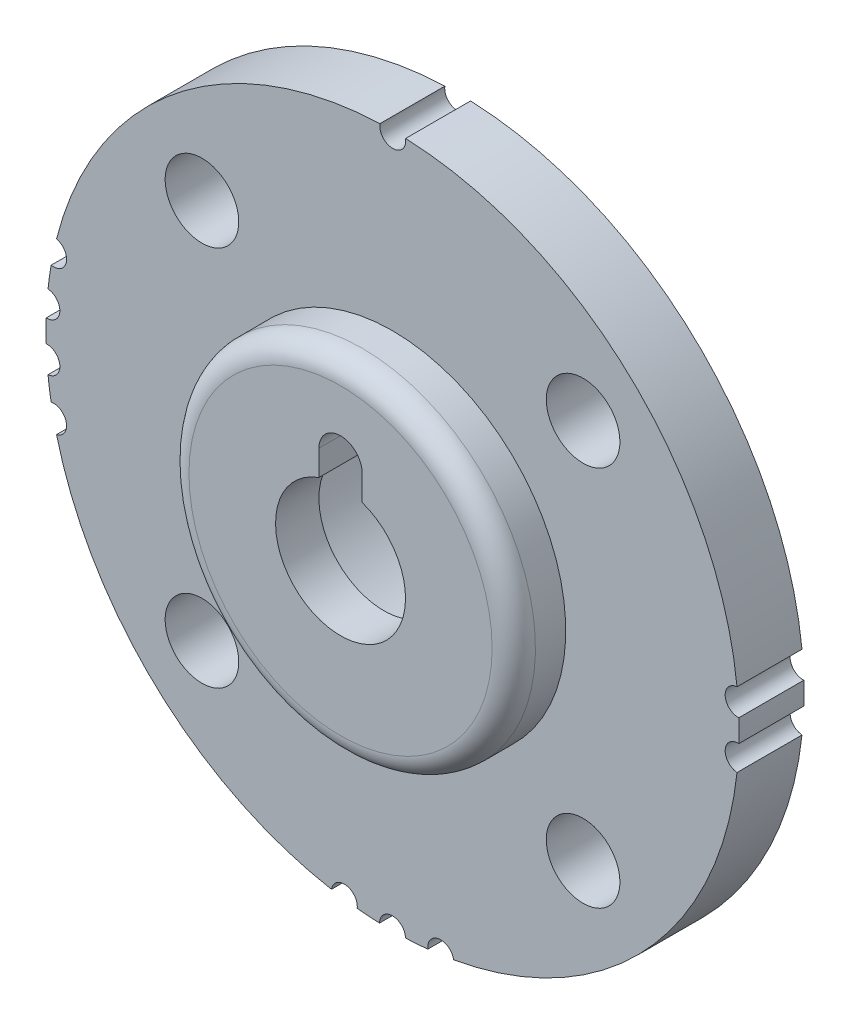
ISO-10303-21;
HEADER;
FILE_DESCRIPTION(('STEP AP214'),'2;1');
FILE_NAME('part.step','',(''),(''),'','','');
FILE_SCHEMA(('AUTOMOTIVE_DESIGN { 1 0 10303 214 1 1 1 1 }'));
ENDSEC;
DATA;
#1=APPLICATION_CONTEXT('core data for automotive mechanical design processes');
#2=APPLICATION_PROTOCOL_DEFINITION('international standard','automotive_design',2000,#1);
#3=PRODUCT_CONTEXT('',#1,'mechanical');
#4=PRODUCT('Part','Part','',(#3));
#5=PRODUCT_RELATED_PRODUCT_CATEGORY('part','',(#4));
#6=PRODUCT_DEFINITION_FORMATION('','',#4);
#7=PRODUCT_DEFINITION_CONTEXT('part definition',#1,'design');
#8=PRODUCT_DEFINITION('design','',#6,#7);
#9=PRODUCT_DEFINITION_SHAPE('','',#8);
#10=(LENGTH_UNIT() NAMED_UNIT(*) SI_UNIT(.MILLI.,.METRE.));
#11=(NAMED_UNIT(*) PLANE_ANGLE_UNIT() SI_UNIT($,.RADIAN.));
#12=(NAMED_UNIT(*) SI_UNIT($,.STERADIAN.) SOLID_ANGLE_UNIT());
#13=UNCERTAINTY_MEASURE_WITH_UNIT(LENGTH_MEASURE(1.E-05),#10,'distance_accuracy_value','');
#14=(GEOMETRIC_REPRESENTATION_CONTEXT(3) GLOBAL_UNCERTAINTY_ASSIGNED_CONTEXT((#13)) GLOBAL_UNIT_ASSIGNED_CONTEXT((#10,
#11,#12)) REPRESENTATION_CONTEXT('',''));
#15=CARTESIAN_POINT('',(0.,0.,0.));
#16=DIRECTION('',(0.,0.,1.));
#17=DIRECTION('',(1.,0.,0.));
#18=AXIS2_PLACEMENT_3D('',#15,#16,#17);
#19=CARTESIAN_POINT('',(0.,0.,-4.0142399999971));
#20=DIRECTION('',(0.,0.,1.));
#21=DIRECTION('',(0.,-1.,0.));
#22=AXIS2_PLACEMENT_3D('',#19,#20,#21);
#23=CYLINDRICAL_SURFACE('',#22,8.);
#24=DIRECTION('',(0.,0.,1.));
#25=VECTOR('',#24,1.);
#26=CARTESIAN_POINT('',(-7.9958243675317,0.258442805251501,-4.0142399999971));
#27=LINE('',#26,#25);
#28=CARTESIAN_POINT('',(-7.9958243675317,0.258442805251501,0.));
#29=VERTEX_POINT('',#28);
#30=CARTESIAN_POINT('',(-7.9958243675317,0.258442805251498,-1.4999999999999));
#31=VERTEX_POINT('',#30);
#32=EDGE_CURVE('E187',#29,#31,#27,.F.);
#33=ORIENTED_EDGE('',*,*,#32,.T.);
#34=CARTESIAN_POINT('',(0.,0.,-1.4999999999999));
#35=DIRECTION('',(0.,0.,1.));
#36=DIRECTION('',(0.,-1.,0.));
#37=AXIS2_PLACEMENT_3D('',#34,#35,#36);
#38=CIRCLE('',#37,8.);
#39=CARTESIAN_POINT('',(-7.99582436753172,-0.258442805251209,-1.4999999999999));
#40=VERTEX_POINT('',#39);
#41=EDGE_CURVE('E163',#31,#40,#38,.T.);
#42=ORIENTED_EDGE('',*,*,#41,.T.);
#43=DIRECTION('',(0.,0.,1.));
#44=VECTOR('',#43,1.);
#45=CARTESIAN_POINT('',(-7.99582436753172,-0.258442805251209,-4.0142399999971));
#46=LINE('',#45,#44);
#47=CARTESIAN_POINT('',(-7.99582436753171,-0.258442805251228,0.));
#48=VERTEX_POINT('',#47);
#49=EDGE_CURVE('E166',#40,#48,#46,.T.);
#50=ORIENTED_EDGE('',*,*,#49,.T.);
#51=CARTESIAN_POINT('',(0.,0.,0.));
#52=DIRECTION('',(0.,0.,1.));
#53=DIRECTION('',(0.,-1.,0.));
#54=AXIS2_PLACEMENT_3D('',#51,#52,#53);
#55=CIRCLE('',#54,8.);
#56=EDGE_CURVE('E20',#48,#29,#55,.F.);
#57=ORIENTED_EDGE('',*,*,#56,.T.);
#58=EDGE_LOOP('',(#33,#42,#50,#57));
#59=FACE_BOUND('',#58,.T.);
#60=ADVANCED_FACE('F17',(#59),#23,.T.);
#61=CARTESIAN_POINT('',(0.,2.00000000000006,-4.0142399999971));
#62=DIRECTION('',(0.,0.,1.));
#63=DIRECTION('',(0.,-1.,0.));
#64=AXIS2_PLACEMENT_3D('',#61,#62,#63);
#65=CYLINDRICAL_SURFACE('',#64,0.5);
#66=DIRECTION('',(0.,0.,1.));
#67=VECTOR('',#66,1.);
#68=CARTESIAN_POINT('',(0.500000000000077,2.00000000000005,-4.0142399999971));
#69=LINE('',#68,#67);
#70=CARTESIAN_POINT('',(0.500000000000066,2.00000000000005,0.200000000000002));
#71=VERTEX_POINT('',#70);
#72=CARTESIAN_POINT('',(0.500000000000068,2.00000000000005,1.2));
#73=VERTEX_POINT('',#72);
#74=EDGE_CURVE('E196',#71,#73,#69,.T.);
#75=ORIENTED_EDGE('',*,*,#74,.T.);
#76=CARTESIAN_POINT('',(0.,2.00000000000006,1.2));
#77=DIRECTION('',(0.,0.,1.));
#78=DIRECTION('',(0.,-1.,0.));
#79=AXIS2_PLACEMENT_3D('',#76,#77,#78);
#80=CIRCLE('',#79,0.5);
#81=CARTESIAN_POINT('',(-0.499999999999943,2.00000000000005,1.2));
#82=VERTEX_POINT('',#81);
#83=EDGE_CURVE('E189',#82,#73,#80,.F.);
#84=ORIENTED_EDGE('',*,*,#83,.F.);
#85=DIRECTION('',(0.,0.,1.));
#86=VECTOR('',#85,1.);
#87=CARTESIAN_POINT('',(-0.499999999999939,2.00000000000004,-4.0142399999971));
#88=LINE('',#87,#86);
#89=CARTESIAN_POINT('',(-0.499999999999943,2.00000000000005,0.200000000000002));
#90=VERTEX_POINT('',#89);
#91=EDGE_CURVE('E203',#82,#90,#88,.F.);
#92=ORIENTED_EDGE('',*,*,#91,.T.);
#93=CARTESIAN_POINT('',(0.,2.00000000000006,0.200000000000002));
#94=DIRECTION('',(0.,0.,1.));
#95=DIRECTION('',(0.,-1.,0.));
#96=AXIS2_PLACEMENT_3D('',#93,#94,#95);
#97=CIRCLE('',#96,0.5);
#98=EDGE_CURVE('E174',#90,#71,#97,.F.);
#99=ORIENTED_EDGE('',*,*,#98,.T.);
#100=EDGE_LOOP('',(#75,#84,#92,#99));
#101=FACE_BOUND('',#100,.T.);
#102=ADVANCED_FACE('F393',(#101),#65,.F.);
#103=CARTESIAN_POINT('',(0.500000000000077,2.00000000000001,-4.0142399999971));
#104=DIRECTION('',(1.,0.,0.));
#105=DIRECTION('',(0.,1.,0.));
#106=AXIS2_PLACEMENT_3D('',#103,#104,#105);
#107=PLANE('',#106);
#108=DIRECTION('',(0.,-1.,0.));
#109=VECTOR('',#108,1.);
#110=CARTESIAN_POINT('',(0.500000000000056,1.91294517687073,0.200000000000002));
#111=LINE('',#110,#109);
#112=CARTESIAN_POINT('',(0.500000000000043,1.41421356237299,0.200000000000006));
#113=VERTEX_POINT('',#112);
#114=EDGE_CURVE('E176',#71,#113,#111,.T.);
#115=ORIENTED_EDGE('',*,*,#114,.T.);
#116=DIRECTION('',(0.,0.,1.));
#117=VECTOR('',#116,1.);
#118=CARTESIAN_POINT('',(0.500000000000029,1.41421356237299,-4.1640024));
#119=LINE('',#118,#117);
#120=CARTESIAN_POINT('',(0.500000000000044,1.41421356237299,1.2));
#121=VERTEX_POINT('',#120);
#122=EDGE_CURVE('E197',#113,#121,#119,.T.);
#123=ORIENTED_EDGE('',*,*,#122,.T.);
#124=DIRECTION('',(0.,-1.,0.));
#125=VECTOR('',#124,1.);
#126=CARTESIAN_POINT('',(0.500000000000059,0.0897356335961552,1.2));
#127=LINE('',#126,#125);
#128=EDGE_CURVE('E195',#73,#121,#127,.T.);
#129=ORIENTED_EDGE('',*,*,#128,.F.);
#130=ORIENTED_EDGE('',*,*,#74,.F.);
#131=EDGE_LOOP('',(#115,#123,#129,#130));
#132=FACE_BOUND('',#131,.T.);
#133=ADVANCED_FACE('F391',(#132),#107,.F.);
#134=CARTESIAN_POINT('',(0.,0.,-4.1640024));
#135=DIRECTION('',(0.,0.,1.));
#136=DIRECTION('',(0.,-1.,0.));
#137=AXIS2_PLACEMENT_3D('',#134,#135,#136);
#138=CYLINDRICAL_SURFACE('',#137,1.5);
#139=CARTESIAN_POINT('',(0.,0.,1.2));
#140=DIRECTION('',(0.,0.,1.));
#141=DIRECTION('',(0.,-1.,0.));
#142=AXIS2_PLACEMENT_3D('',#139,#140,#141);
#143=CIRCLE('',#142,1.5);
#144=CARTESIAN_POINT('',(-0.499999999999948,1.41421356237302,1.2));
#145=VERTEX_POINT('',#144);
#146=EDGE_CURVE('E193',#121,#145,#143,.F.);
#147=ORIENTED_EDGE('',*,*,#146,.F.);
#148=ORIENTED_EDGE('',*,*,#122,.F.);
#149=CARTESIAN_POINT('',(0.,0.,0.200000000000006));
#150=DIRECTION('',(0.,0.,1.));
#151=DIRECTION('',(0.,-1.,0.));
#152=AXIS2_PLACEMENT_3D('',#149,#150,#151);
#153=CIRCLE('',#152,1.5);
#154=CARTESIAN_POINT('',(-0.499999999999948,1.41421356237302,0.200000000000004));
#155=VERTEX_POINT('',#154);
#156=EDGE_CURVE('E341',#113,#155,#153,.F.);
#157=ORIENTED_EDGE('',*,*,#156,.T.);
#158=DIRECTION('',(0.,0.,1.));
#159=VECTOR('',#158,1.);
#160=CARTESIAN_POINT('',(-0.499999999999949,1.41421356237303,-4.0142399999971));
#161=LINE('',#160,#159);
#162=EDGE_CURVE('E622',#155,#145,#161,.T.);
#163=ORIENTED_EDGE('',*,*,#162,.T.);
#164=EDGE_LOOP('',(#147,#148,#157,#163));
#165=FACE_BOUND('',#164,.T.);
#166=ADVANCED_FACE('F387',(#165),#138,.F.);
#167=CARTESIAN_POINT('',(-0.499999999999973,0.,-4.0142399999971));
#168=DIRECTION('',(-1.,0.,0.));
#169=DIRECTION('',(0.,-1.,0.));
#170=AXIS2_PLACEMENT_3D('',#167,#168,#169);
#171=PLANE('',#170);
#172=ORIENTED_EDGE('',*,*,#162,.F.);
#173=DIRECTION('',(0.,-1.,0.));
#174=VECTOR('',#173,1.);
#175=CARTESIAN_POINT('',(-0.499999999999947,1.91294517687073,0.200000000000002));
#176=LINE('',#175,#174);
#177=EDGE_CURVE('E342',#155,#90,#176,.F.);
#178=ORIENTED_EDGE('',*,*,#177,.T.);
#179=ORIENTED_EDGE('',*,*,#91,.F.);
#180=DIRECTION('',(0.,-1.,0.));
#181=VECTOR('',#180,1.);
#182=CARTESIAN_POINT('',(-0.499999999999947,0.0897356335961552,1.2));
#183=LINE('',#182,#181);
#184=EDGE_CURVE('E192',#145,#82,#183,.F.);
#185=ORIENTED_EDGE('',*,*,#184,.F.);
#186=EDGE_LOOP('',(#172,#178,#179,#185));
#187=FACE_BOUND('',#186,.T.);
#188=ADVANCED_FACE('F382',(#187),#171,.F.);
#189=CARTESIAN_POINT('',(-3.21649621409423,0.0897356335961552,1.2));
#190=DIRECTION('',(0.,0.,1.));
#191=DIRECTION('',(0.,-1.,0.));
#192=AXIS2_PLACEMENT_3D('',#189,#190,#191);
#193=PLANE('',#192);
#194=ORIENTED_EDGE('',*,*,#184,.T.);
#195=ORIENTED_EDGE('',*,*,#83,.T.);
#196=ORIENTED_EDGE('',*,*,#128,.T.);
#197=ORIENTED_EDGE('',*,*,#146,.T.);
#198=EDGE_LOOP('',(#194,#195,#196,#197));
#199=FACE_BOUND('',#198,.T.);
#200=CARTESIAN_POINT('',(0.,0.,1.20000000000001));
#201=DIRECTION('',(0.,0.,-1.));
#202=DIRECTION('',(-1.,0.,0.));
#203=AXIS2_PLACEMENT_3D('',#200,#201,#202);
#204=CIRCLE('',#203,3.49999999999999);
#205=CARTESIAN_POINT('',(-3.49999999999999,0.,1.20000000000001));
#206=VERTEX_POINT('',#205);
#207=EDGE_CURVE('E348',#206,#206,#204,.T.);
#208=ORIENTED_EDGE('',*,*,#207,.F.);
#209=EDGE_LOOP('',(#208));
#210=FACE_BOUND('',#209,.T.);
#211=ADVANCED_FACE('F371',(#199,#210),#193,.T.);
#212=CARTESIAN_POINT('',(-7.98051240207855,0.558051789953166,-4.0142399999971));
#213=DIRECTION('',(0.,0.,1.));
#214=DIRECTION('',(0.,-1.,0.));
#215=AXIS2_PLACEMENT_3D('',#212,#213,#214);
#216=CYLINDRICAL_SURFACE('',#215,0.300000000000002);
#217=ORIENTED_EDGE('',*,*,#32,.F.);
#218=CARTESIAN_POINT('',(-7.98051240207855,0.558051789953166,0.));
#219=DIRECTION('',(0.,0.,1.));
#220=DIRECTION('',(0.,-1.,0.));
#221=AXIS2_PLACEMENT_3D('',#218,#219,#220);
#222=CIRCLE('',#221,0.300000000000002);
#223=CARTESIAN_POINT('',(-7.95397784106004,0.85687601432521,0.));
#224=VERTEX_POINT('',#223);
#225=EDGE_CURVE('E159',#224,#29,#222,.F.);
#226=ORIENTED_EDGE('',*,*,#225,.F.);
#227=DIRECTION('',(0.,0.,1.));
#228=VECTOR('',#227,1.);
#229=CARTESIAN_POINT('',(-7.95397784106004,0.856876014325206,-4.0142399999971));
#230=LINE('',#229,#228);
#231=CARTESIAN_POINT('',(-7.95397784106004,0.85687601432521,-1.4999999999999));
#232=VERTEX_POINT('',#231);
#233=EDGE_CURVE('E340',#232,#224,#230,.T.);
#234=ORIENTED_EDGE('',*,*,#233,.F.);
#235=CARTESIAN_POINT('',(-7.98051240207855,0.558051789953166,-1.4999999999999));
#236=DIRECTION('',(0.,0.,1.));
#237=DIRECTION('',(0.,-1.,0.));
#238=AXIS2_PLACEMENT_3D('',#235,#236,#237);
#239=CIRCLE('',#238,0.300000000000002);
#240=EDGE_CURVE('E185',#31,#232,#239,.T.);
#241=ORIENTED_EDGE('',*,*,#240,.F.);
#242=EDGE_LOOP('',(#217,#226,#234,#241));
#243=FACE_BOUND('',#242,.T.);
#244=ADVANCED_FACE('F381',(#243),#216,.F.);
#245=CARTESIAN_POINT('',(-1.38777878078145E-13,-7.99999999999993,-4.0142399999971));
#246=DIRECTION('',(0.,0.,1.));
#247=DIRECTION('',(0.,-1.,0.));
#248=AXIS2_PLACEMENT_3D('',#245,#246,#247);
#249=CYLINDRICAL_SURFACE('',#248,0.3);
#250=DIRECTION('',(0.,0.,1.));
#251=VECTOR('',#250,1.);
#252=CARTESIAN_POINT('',(0.299947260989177,-7.99437500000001,-4.0142399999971));
#253=LINE('',#252,#251);
#254=CARTESIAN_POINT('',(0.299947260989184,-7.99437500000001,0.));
#255=VERTEX_POINT('',#254);
#256=CARTESIAN_POINT('',(0.299947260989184,-7.99437500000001,-1.4999999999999));
#257=VERTEX_POINT('',#256);
#258=EDGE_CURVE('E327',#255,#257,#253,.F.);
#259=ORIENTED_EDGE('',*,*,#258,.F.);
#260=CARTESIAN_POINT('',(-1.38793311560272E-13,-7.99999999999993,0.));
#261=DIRECTION('',(0.,0.,1.));
#262=DIRECTION('',(0.,-1.,0.));
#263=AXIS2_PLACEMENT_3D('',#260,#261,#262);
#264=CIRCLE('',#263,0.3);
#265=CARTESIAN_POINT('',(-0.299947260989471,-7.99437499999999,0.));
#266=VERTEX_POINT('',#265);
#267=EDGE_CURVE('E183',#266,#255,#264,.F.);
#268=ORIENTED_EDGE('',*,*,#267,.F.);
#269=DIRECTION('',(0.,0.,1.));
#270=VECTOR('',#269,1.);
#271=CARTESIAN_POINT('',(-0.299947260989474,-7.99437499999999,-4.0142399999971));
#272=LINE('',#271,#270);
#273=CARTESIAN_POINT('',(-0.299947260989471,-7.99437499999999,-1.4999999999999));
#274=VERTEX_POINT('',#273);
#275=EDGE_CURVE('E324',#274,#266,#272,.T.);
#276=ORIENTED_EDGE('',*,*,#275,.F.);
#277=CARTESIAN_POINT('',(-1.38787544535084E-13,-7.99999999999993,-1.4999999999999));
#278=DIRECTION('',(0.,0.,1.));
#279=DIRECTION('',(0.,-1.,0.));
#280=AXIS2_PLACEMENT_3D('',#277,#278,#279);
#281=CIRCLE('',#280,0.3);
#282=EDGE_CURVE('E181',#257,#274,#281,.T.);
#283=ORIENTED_EDGE('',*,*,#282,.F.);
#284=EDGE_LOOP('',(#259,#268,#276,#283));
#285=FACE_BOUND('',#284,.T.);
#286=ADVANCED_FACE('F597',(#285),#249,.F.);
#287=CARTESIAN_POINT('',(-7.98051240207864,-0.558051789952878,-4.0142399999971));
#288=DIRECTION('',(0.,0.,1.));
#289=DIRECTION('',(0.,-1.,0.));
#290=AXIS2_PLACEMENT_3D('',#287,#288,#289);
#291=CYLINDRICAL_SURFACE('',#290,0.300000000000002);
#292=CARTESIAN_POINT('',(-7.98051240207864,-0.558051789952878,0.));
#293=DIRECTION('',(0.,0.,1.));
#294=DIRECTION('',(0.,-1.,0.));
#295=AXIS2_PLACEMENT_3D('',#292,#293,#294);
#296=CIRCLE('',#295,0.300000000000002);
#297=CARTESIAN_POINT('',(-7.95397784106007,-0.856876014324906,0.));
#298=VERTEX_POINT('',#297);
#299=EDGE_CURVE('E156',#48,#298,#296,.F.);
#300=ORIENTED_EDGE('',*,*,#299,.F.);
#301=ORIENTED_EDGE('',*,*,#49,.F.);
#302=CARTESIAN_POINT('',(-7.98051240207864,-0.558051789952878,-1.4999999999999));
#303=DIRECTION('',(0.,0.,1.));
#304=DIRECTION('',(0.,-1.,0.));
#305=AXIS2_PLACEMENT_3D('',#302,#303,#304);
#306=CIRCLE('',#305,0.300000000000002);
#307=CARTESIAN_POINT('',(-7.95397784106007,-0.856876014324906,-1.4999999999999));
#308=VERTEX_POINT('',#307);
#309=EDGE_CURVE('E168',#308,#40,#306,.T.);
#310=ORIENTED_EDGE('',*,*,#309,.F.);
#311=DIRECTION('',(0.,0.,1.));
#312=VECTOR('',#311,1.);
#313=CARTESIAN_POINT('',(-7.95397784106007,-0.856876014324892,-4.0142399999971));
#314=LINE('',#313,#312);
#315=EDGE_CURVE('E172',#298,#308,#314,.F.);
#316=ORIENTED_EDGE('',*,*,#315,.F.);
#317=EDGE_LOOP('',(#300,#301,#310,#316));
#318=FACE_BOUND('',#317,.T.);
#319=ADVANCED_FACE('F170',(#318),#291,.F.);
#320=CARTESIAN_POINT('',(-0.744255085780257,1.91294517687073,0.200000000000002));
#321=DIRECTION('',(0.,0.,1.));
#322=DIRECTION('',(0.,-1.,0.));
#323=AXIS2_PLACEMENT_3D('',#320,#321,#322);
#324=PLANE('',#323);
#325=ORIENTED_EDGE('',*,*,#156,.F.);
#326=ORIENTED_EDGE('',*,*,#114,.F.);
#327=ORIENTED_EDGE('',*,*,#98,.F.);
#328=ORIENTED_EDGE('',*,*,#177,.F.);
#329=EDGE_LOOP('',(#325,#326,#327,#328));
#330=FACE_BOUND('',#329,.T.);
#331=CARTESIAN_POINT('',(0.,0.,0.200000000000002));
#332=DIRECTION('',(0.,0.,-1.));
#333=DIRECTION('',(0.,1.,0.));
#334=AXIS2_PLACEMENT_3D('',#331,#332,#333);
#335=CIRCLE('',#334,3.);
#336=CARTESIAN_POINT('',(0.,2.99999999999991,0.200000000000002));
#337=VERTEX_POINT('',#336);
#338=EDGE_CURVE('E311',#337,#337,#335,.T.);
#339=ORIENTED_EDGE('',*,*,#338,.T.);
#340=EDGE_LOOP('',(#339));
#341=FACE_BOUND('',#340,.T.);
#342=ADVANCED_FACE('F510',(#330,#341),#324,.F.);
#343=CARTESIAN_POINT('',(0.,0.,0.700000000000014));
#344=DIRECTION('',(0.,0.,-1.));
#345=DIRECTION('',(-1.,0.,0.));
#346=AXIS2_PLACEMENT_3D('',#343,#344,#345);
#347=TOROIDAL_SURFACE('',#346,3.5,0.499999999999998);
#348=CARTESIAN_POINT('',(0.,0.,0.700000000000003));
#349=DIRECTION('',(0.,0.,-1.));
#350=DIRECTION('',(0.,1.,0.));
#351=AXIS2_PLACEMENT_3D('',#348,#349,#350);
#352=CIRCLE('',#351,4.);
#353=CARTESIAN_POINT('',(0.,3.99999999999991,0.700000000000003));
#354=VERTEX_POINT('',#353);
#355=EDGE_CURVE('E314',#354,#354,#352,.T.);
#356=ORIENTED_EDGE('',*,*,#355,.F.);
#357=EDGE_LOOP('',(#356));
#358=FACE_BOUND('',#357,.T.);
#359=ORIENTED_EDGE('',*,*,#207,.T.);
#360=EDGE_LOOP('',(#359));
#361=FACE_BOUND('',#360,.T.);
#362=ADVANCED_FACE('F505',(#358,#361),#347,.T.);
#363=CARTESIAN_POINT('',(0.,0.,-4.0142399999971));
#364=DIRECTION('',(0.,0.,1.));
#365=DIRECTION('',(0.,-1.,0.));
#366=AXIS2_PLACEMENT_3D('',#363,#364,#365);
#367=CYLINDRICAL_SURFACE('',#366,8.);
#368=DIRECTION('',(0.,0.,1.));
#369=VECTOR('',#368,1.);
#370=CARTESIAN_POINT('',(-7.88204126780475,1.36873132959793,-4.0142399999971));
#371=LINE('',#370,#369);
#372=CARTESIAN_POINT('',(-7.88204126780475,1.36873132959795,0.));
#373=VERTEX_POINT('',#372);
#374=CARTESIAN_POINT('',(-7.88204126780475,1.36873132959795,-1.4999999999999));
#375=VERTEX_POINT('',#374);
#376=EDGE_CURVE('E310',#373,#375,#371,.F.);
#377=ORIENTED_EDGE('',*,*,#376,.T.);
#378=CARTESIAN_POINT('',(0.,0.,-1.4999999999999));
#379=DIRECTION('',(0.,0.,1.));
#380=DIRECTION('',(0.,-1.,0.));
#381=AXIS2_PLACEMENT_3D('',#378,#379,#380);
#382=CIRCLE('',#381,8.);
#383=EDGE_CURVE('E336',#375,#232,#382,.T.);
#384=ORIENTED_EDGE('',*,*,#383,.T.);
#385=ORIENTED_EDGE('',*,*,#233,.T.);
#386=CARTESIAN_POINT('',(0.,0.,0.));
#387=DIRECTION('',(0.,0.,1.));
#388=DIRECTION('',(0.,-1.,0.));
#389=AXIS2_PLACEMENT_3D('',#386,#387,#388);
#390=CIRCLE('',#389,8.);
#391=EDGE_CURVE('E339',#224,#373,#390,.F.);
#392=ORIENTED_EDGE('',*,*,#391,.T.);
#393=EDGE_LOOP('',(#377,#384,#385,#392));
#394=FACE_BOUND('',#393,.T.);
#395=ADVANCED_FACE('F501',(#394),#367,.T.);
#396=CARTESIAN_POINT('',(0.,0.,-4.0142399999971));
#397=DIRECTION('',(0.,0.,1.));
#398=DIRECTION('',(0.,-1.,0.));
#399=AXIS2_PLACEMENT_3D('',#396,#397,#398);
#400=CYLINDRICAL_SURFACE('',#399,8.);
#401=CARTESIAN_POINT('',(0.,0.,0.));
#402=DIRECTION('',(0.,0.,1.));
#403=DIRECTION('',(0.,-1.,0.));
#404=AXIS2_PLACEMENT_3D('',#401,#402,#403);
#405=CIRCLE('',#404,8.);
#406=CARTESIAN_POINT('',(7.99582436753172,0.258442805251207,0.));
#407=VERTEX_POINT('',#406);
#408=CARTESIAN_POINT('',(7.99582436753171,-0.258442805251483,0.));
#409=VERTEX_POINT('',#408);
#410=EDGE_CURVE('E331',#407,#409,#405,.F.);
#411=ORIENTED_EDGE('',*,*,#410,.T.);
#412=DIRECTION('',(0.,0.,1.));
#413=VECTOR('',#412,1.);
#414=CARTESIAN_POINT('',(7.99582436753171,-0.258442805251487,-4.0142399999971));
#415=LINE('',#414,#413);
#416=CARTESIAN_POINT('',(7.99582436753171,-0.258442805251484,-1.4999999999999));
#417=VERTEX_POINT('',#416);
#418=EDGE_CURVE('E302',#409,#417,#415,.F.);
#419=ORIENTED_EDGE('',*,*,#418,.T.);
#420=CARTESIAN_POINT('',(0.,0.,-1.4999999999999));
#421=DIRECTION('',(0.,0.,1.));
#422=DIRECTION('',(0.,-1.,0.));
#423=AXIS2_PLACEMENT_3D('',#420,#421,#422);
#424=CIRCLE('',#423,8.);
#425=CARTESIAN_POINT('',(7.99582436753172,0.25844280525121,-1.4999999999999));
#426=VERTEX_POINT('',#425);
#427=EDGE_CURVE('E333',#417,#426,#424,.T.);
#428=ORIENTED_EDGE('',*,*,#427,.T.);
#429=DIRECTION('',(0.,0.,1.));
#430=VECTOR('',#429,1.);
#431=CARTESIAN_POINT('',(7.99582436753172,0.25844280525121,-4.0142399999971));
#432=LINE('',#431,#430);
#433=EDGE_CURVE('E305',#426,#407,#432,.T.);
#434=ORIENTED_EDGE('',*,*,#433,.T.);
#435=EDGE_LOOP('',(#411,#419,#428,#434));
#436=FACE_BOUND('',#435,.T.);
#437=ADVANCED_FACE('F497',(#436),#400,.T.);
#438=CARTESIAN_POINT('',(0.,0.,-4.0142399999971));
#439=DIRECTION('',(0.,0.,1.));
#440=DIRECTION('',(0.,-1.,0.));
#441=AXIS2_PLACEMENT_3D('',#438,#439,#440);
#442=CYLINDRICAL_SURFACE('',#441,8.);
#443=ORIENTED_EDGE('',*,*,#258,.T.);
#444=CARTESIAN_POINT('',(0.,0.,-1.4999999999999));
#445=DIRECTION('',(0.,0.,1.));
#446=DIRECTION('',(0.,-1.,0.));
#447=AXIS2_PLACEMENT_3D('',#444,#445,#446);
#448=CIRCLE('',#447,8.);
#449=CARTESIAN_POINT('',(0.815573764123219,-7.95831888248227,-1.4999999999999));
#450=VERTEX_POINT('',#449);
#451=EDGE_CURVE('E325',#257,#450,#448,.T.);
#452=ORIENTED_EDGE('',*,*,#451,.T.);
#453=DIRECTION('',(0.,0.,1.));
#454=VECTOR('',#453,1.);
#455=CARTESIAN_POINT('',(0.815573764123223,-7.95831888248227,-4.0142399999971));
#456=LINE('',#455,#454);
#457=CARTESIAN_POINT('',(0.815573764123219,-7.95831888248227,0.));
#458=VERTEX_POINT('',#457);
#459=EDGE_CURVE('E299',#450,#458,#456,.T.);
#460=ORIENTED_EDGE('',*,*,#459,.T.);
#461=CARTESIAN_POINT('',(0.,0.,0.));
#462=DIRECTION('',(0.,0.,1.));
#463=DIRECTION('',(0.,-1.,0.));
#464=AXIS2_PLACEMENT_3D('',#461,#462,#463);
#465=CIRCLE('',#464,8.);
#466=EDGE_CURVE('E328',#458,#255,#465,.F.);
#467=ORIENTED_EDGE('',*,*,#466,.T.);
#468=EDGE_LOOP('',(#443,#452,#460,#467));
#469=FACE_BOUND('',#468,.T.);
#470=ADVANCED_FACE('F493',(#469),#442,.T.);
#471=CARTESIAN_POINT('',(0.,0.,-4.0142399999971));
#472=DIRECTION('',(0.,0.,1.));
#473=DIRECTION('',(0.,-1.,0.));
#474=AXIS2_PLACEMENT_3D('',#471,#472,#473);
#475=CYLINDRICAL_SURFACE('',#474,8.);
#476=DIRECTION('',(0.,0.,1.));
#477=VECTOR('',#476,1.);
#478=CARTESIAN_POINT('',(-0.815573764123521,-7.95831888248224,-4.0142399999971));
#479=LINE('',#478,#477);
#480=CARTESIAN_POINT('',(-0.815573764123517,-7.95831888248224,0.));
#481=VERTEX_POINT('',#480);
#482=CARTESIAN_POINT('',(-0.815573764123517,-7.95831888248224,-1.4999999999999));
#483=VERTEX_POINT('',#482);
#484=EDGE_CURVE('E295',#481,#483,#479,.F.);
#485=ORIENTED_EDGE('',*,*,#484,.T.);
#486=CARTESIAN_POINT('',(0.,0.,-1.4999999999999));
#487=DIRECTION('',(0.,0.,1.));
#488=DIRECTION('',(0.,-1.,0.));
#489=AXIS2_PLACEMENT_3D('',#486,#487,#488);
#490=CIRCLE('',#489,8.);
#491=EDGE_CURVE('E319',#483,#274,#490,.T.);
#492=ORIENTED_EDGE('',*,*,#491,.T.);
#493=ORIENTED_EDGE('',*,*,#275,.T.);
#494=CARTESIAN_POINT('',(0.,0.,0.));
#495=DIRECTION('',(0.,0.,1.));
#496=DIRECTION('',(0.,-1.,0.));
#497=AXIS2_PLACEMENT_3D('',#494,#495,#496);
#498=CIRCLE('',#497,8.);
#499=EDGE_CURVE('E322',#266,#481,#498,.F.);
#500=ORIENTED_EDGE('',*,*,#499,.T.);
#501=EDGE_LOOP('',(#485,#492,#493,#500));
#502=FACE_BOUND('',#501,.T.);
#503=ADVANCED_FACE('F489',(#502),#475,.T.);
#504=CARTESIAN_POINT('',(0.,0.,-4.0142399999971));
#505=DIRECTION('',(0.,0.,1.));
#506=DIRECTION('',(0.,-1.,0.));
#507=AXIS2_PLACEMENT_3D('',#504,#505,#506);
#508=CYLINDRICAL_SURFACE('',#507,8.);
#509=ORIENTED_EDGE('',*,*,#315,.T.);
#510=CARTESIAN_POINT('',(0.,0.,-1.4999999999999));
#511=DIRECTION('',(0.,0.,1.));
#512=DIRECTION('',(0.,-1.,0.));
#513=AXIS2_PLACEMENT_3D('',#510,#511,#512);
#514=CIRCLE('',#513,8.);
#515=CARTESIAN_POINT('',(-7.88204126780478,-1.36873132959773,-1.4999999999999));
#516=VERTEX_POINT('',#515);
#517=EDGE_CURVE('E315',#308,#516,#514,.T.);
#518=ORIENTED_EDGE('',*,*,#517,.T.);
#519=DIRECTION('',(0.,0.,1.));
#520=VECTOR('',#519,1.);
#521=CARTESIAN_POINT('',(-7.88204126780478,-1.36873132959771,-4.0142399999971));
#522=LINE('',#521,#520);
#523=CARTESIAN_POINT('',(-7.88204126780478,-1.36873132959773,0.));
#524=VERTEX_POINT('',#523);
#525=EDGE_CURVE('E293',#516,#524,#522,.T.);
#526=ORIENTED_EDGE('',*,*,#525,.T.);
#527=CARTESIAN_POINT('',(0.,0.,0.));
#528=DIRECTION('',(0.,0.,1.));
#529=DIRECTION('',(0.,-1.,0.));
#530=AXIS2_PLACEMENT_3D('',#527,#528,#529);
#531=CIRCLE('',#530,8.);
#532=EDGE_CURVE('E317',#524,#298,#531,.F.);
#533=ORIENTED_EDGE('',*,*,#532,.T.);
#534=EDGE_LOOP('',(#509,#518,#526,#533));
#535=FACE_BOUND('',#534,.T.);
#536=ADVANCED_FACE('F485',(#535),#508,.T.);
#537=CARTESIAN_POINT('',(0.,0.,-3.5));
#538=DIRECTION('',(0.,0.,-1.));
#539=DIRECTION('',(0.,1.,0.));
#540=AXIS2_PLACEMENT_3D('',#537,#538,#539);
#541=CYLINDRICAL_SURFACE('',#540,3.);
#542=CARTESIAN_POINT('',(0.,0.,-3.5));
#543=DIRECTION('',(0.,0.,-1.));
#544=DIRECTION('',(0.,1.,0.));
#545=AXIS2_PLACEMENT_3D('',#542,#543,#544);
#546=CIRCLE('',#545,3.);
#547=CARTESIAN_POINT('',(0.,2.99999999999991,-3.5));
#548=VERTEX_POINT('',#547);
#549=EDGE_CURVE('E287',#548,#548,#546,.F.);
#550=ORIENTED_EDGE('',*,*,#549,.F.);
#551=EDGE_LOOP('',(#550));
#552=FACE_BOUND('',#551,.T.);
#553=ORIENTED_EDGE('',*,*,#338,.F.);
#554=EDGE_LOOP('',(#553));
#555=FACE_BOUND('',#554,.T.);
#556=ADVANCED_FACE('F481',(#552,#555),#541,.F.);
#557=CARTESIAN_POINT('',(0.,0.,1.2));
#558=DIRECTION('',(0.,0.,-1.));
#559=DIRECTION('',(0.,1.,0.));
#560=AXIS2_PLACEMENT_3D('',#557,#558,#559);
#561=CYLINDRICAL_SURFACE('',#560,4.);
#562=CARTESIAN_POINT('',(0.,0.,0.));
#563=DIRECTION('',(0.,0.,-1.));
#564=DIRECTION('',(0.,1.,0.));
#565=AXIS2_PLACEMENT_3D('',#562,#563,#564);
#566=CIRCLE('',#565,4.);
#567=CARTESIAN_POINT('',(0.,3.99999999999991,0.));
#568=VERTEX_POINT('',#567);
#569=EDGE_CURVE('E264',#568,#568,#566,.T.);
#570=ORIENTED_EDGE('',*,*,#569,.F.);
#571=EDGE_LOOP('',(#570));
#572=FACE_BOUND('',#571,.T.);
#573=ORIENTED_EDGE('',*,*,#355,.T.);
#574=EDGE_LOOP('',(#573));
#575=FACE_BOUND('',#574,.T.);
#576=ADVANCED_FACE('F477',(#572,#575),#561,.T.);
#577=CARTESIAN_POINT('',(-7.82518080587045,1.66329352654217,-4.0142399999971));
#578=DIRECTION('',(0.,0.,1.));
#579=DIRECTION('',(0.,-1.,0.));
#580=AXIS2_PLACEMENT_3D('',#577,#578,#579);
#581=CYLINDRICAL_SURFACE('',#580,0.300000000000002);
#582=ORIENTED_EDGE('',*,*,#376,.F.);
#583=CARTESIAN_POINT('',(-7.82518080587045,1.66329352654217,0.));
#584=DIRECTION('',(0.,0.,1.));
#585=DIRECTION('',(0.,-1.,0.));
#586=AXIS2_PLACEMENT_3D('',#583,#584,#585);
#587=CIRCLE('',#586,0.300000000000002);
#588=CARTESIAN_POINT('',(-7.75731618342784,1.95551671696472,0.));
#589=VERTEX_POINT('',#588);
#590=EDGE_CURVE('E284',#589,#373,#587,.F.);
#591=ORIENTED_EDGE('',*,*,#590,.F.);
#592=DIRECTION('',(0.,0.,1.));
#593=VECTOR('',#592,1.);
#594=CARTESIAN_POINT('',(-7.75731618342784,1.95551671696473,-4.0142399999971));
#595=LINE('',#594,#593);
#596=CARTESIAN_POINT('',(-7.75731618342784,1.95551671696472,-1.4999999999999));
#597=VERTEX_POINT('',#596);
#598=EDGE_CURVE('E263',#597,#589,#595,.T.);
#599=ORIENTED_EDGE('',*,*,#598,.F.);
#600=CARTESIAN_POINT('',(-7.82518080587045,1.66329352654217,-1.4999999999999));
#601=DIRECTION('',(0.,0.,1.));
#602=DIRECTION('',(0.,-1.,0.));
#603=AXIS2_PLACEMENT_3D('',#600,#601,#602);
#604=CIRCLE('',#603,0.300000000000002);
#605=EDGE_CURVE('E308',#375,#597,#604,.T.);
#606=ORIENTED_EDGE('',*,*,#605,.F.);
#607=EDGE_LOOP('',(#582,#591,#599,#606));
#608=FACE_BOUND('',#607,.T.);
#609=ADVANCED_FACE('F473',(#608),#581,.F.);
#610=CARTESIAN_POINT('',(7.98051240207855,0.558051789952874,-4.0142399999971));
#611=DIRECTION('',(0.,0.,1.));
#612=DIRECTION('',(0.,-1.,0.));
#613=AXIS2_PLACEMENT_3D('',#610,#611,#612);
#614=CYLINDRICAL_SURFACE('',#613,0.300000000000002);
#615=CARTESIAN_POINT('',(7.98051240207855,0.558051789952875,0.));
#616=DIRECTION('',(0.,0.,1.));
#617=DIRECTION('',(0.,-1.,0.));
#618=AXIS2_PLACEMENT_3D('',#615,#616,#617);
#619=CIRCLE('',#618,0.300000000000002);
#620=CARTESIAN_POINT('',(7.95397784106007,0.856876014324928,0.));
#621=VERTEX_POINT('',#620);
#622=EDGE_CURVE('E269',#407,#621,#619,.F.);
#623=ORIENTED_EDGE('',*,*,#622,.F.);
#624=ORIENTED_EDGE('',*,*,#433,.F.);
#625=CARTESIAN_POINT('',(7.98051240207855,0.558051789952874,-1.4999999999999));
#626=DIRECTION('',(0.,0.,1.));
#627=DIRECTION('',(0.,-1.,0.));
#628=AXIS2_PLACEMENT_3D('',#625,#626,#627);
#629=CIRCLE('',#628,0.300000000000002);
#630=CARTESIAN_POINT('',(7.95397784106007,0.856876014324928,-1.4999999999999));
#631=VERTEX_POINT('',#630);
#632=EDGE_CURVE('E306',#631,#426,#629,.T.);
#633=ORIENTED_EDGE('',*,*,#632,.F.);
#634=DIRECTION('',(0.,0.,1.));
#635=VECTOR('',#634,1.);
#636=CARTESIAN_POINT('',(7.95397784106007,0.85687601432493,-4.0142399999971));
#637=LINE('',#636,#635);
#638=EDGE_CURVE('E536',#621,#631,#637,.F.);
#639=ORIENTED_EDGE('',*,*,#638,.F.);
#640=EDGE_LOOP('',(#623,#624,#633,#639));
#641=FACE_BOUND('',#640,.T.);
#642=ADVANCED_FACE('F469',(#641),#614,.F.);
#643=CARTESIAN_POINT('',(0.00536471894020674,7.94604220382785,-4.0142399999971));
#644=DIRECTION('',(0.,0.,1.));
#645=DIRECTION('',(0.,-1.,0.));
#646=AXIS2_PLACEMENT_3D('',#643,#644,#645);
#647=CYLINDRICAL_SURFACE('',#646,0.300000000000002);
#648=CARTESIAN_POINT('',(0.00536471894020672,7.94604220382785,0.));
#649=DIRECTION('',(0.,0.,1.));
#650=DIRECTION('',(0.,-1.,0.));
#651=AXIS2_PLACEMENT_3D('',#648,#649,#650);
#652=CIRCLE('',#651,0.300000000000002);
#653=CARTESIAN_POINT('',(0.301454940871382,7.99431828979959,0.));
#654=VERTEX_POINT('',#653);
#655=CARTESIAN_POINT('',(-0.290660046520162,7.99471805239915,0.));
#656=VERTEX_POINT('',#655);
#657=EDGE_CURVE('E267',#654,#656,#652,.F.);
#658=ORIENTED_EDGE('',*,*,#657,.F.);
#659=DIRECTION('',(0.,0.,1.));
#660=VECTOR('',#659,1.);
#661=CARTESIAN_POINT('',(0.301454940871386,7.99431828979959,-4.0142399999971));
#662=LINE('',#661,#660);
#663=CARTESIAN_POINT('',(0.301454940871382,7.99431828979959,-1.4999999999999));
#664=VERTEX_POINT('',#663);
#665=EDGE_CURVE('E258',#664,#654,#662,.T.);
#666=ORIENTED_EDGE('',*,*,#665,.F.);
#667=CARTESIAN_POINT('',(0.00536471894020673,7.94604220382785,-1.4999999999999));
#668=DIRECTION('',(0.,0.,1.));
#669=DIRECTION('',(0.,-1.,0.));
#670=AXIS2_PLACEMENT_3D('',#667,#668,#669);
#671=CIRCLE('',#670,0.300000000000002);
#672=CARTESIAN_POINT('',(-0.290660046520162,7.99471805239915,-1.4999999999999));
#673=VERTEX_POINT('',#672);
#674=EDGE_CURVE('E303',#673,#664,#671,.T.);
#675=ORIENTED_EDGE('',*,*,#674,.F.);
#676=DIRECTION('',(0.,0.,1.));
#677=VECTOR('',#676,1.);
#678=CARTESIAN_POINT('',(-0.290660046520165,7.99471805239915,-4.0142399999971));
#679=LINE('',#678,#677);
#680=EDGE_CURVE('E262',#656,#673,#679,.F.);
#681=ORIENTED_EDGE('',*,*,#680,.F.);
#682=EDGE_LOOP('',(#658,#666,#675,#681));
#683=FACE_BOUND('',#682,.T.);
#684=ADVANCED_FACE('F465',(#683),#647,.F.);
#685=CARTESIAN_POINT('',(7.98051240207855,-0.558051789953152,-4.0142399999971));
#686=DIRECTION('',(0.,0.,1.));
#687=DIRECTION('',(0.,-1.,0.));
#688=AXIS2_PLACEMENT_3D('',#685,#686,#687);
#689=CYLINDRICAL_SURFACE('',#688,0.300000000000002);
#690=ORIENTED_EDGE('',*,*,#418,.F.);
#691=CARTESIAN_POINT('',(7.98051240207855,-0.558051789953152,0.));
#692=DIRECTION('',(0.,0.,1.));
#693=DIRECTION('',(0.,-1.,0.));
#694=AXIS2_PLACEMENT_3D('',#691,#692,#693);
#695=CIRCLE('',#694,0.300000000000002);
#696=CARTESIAN_POINT('',(7.95397784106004,-0.856876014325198,0.));
#697=VERTEX_POINT('',#696);
#698=EDGE_CURVE('E272',#697,#409,#695,.F.);
#699=ORIENTED_EDGE('',*,*,#698,.F.);
#700=DIRECTION('',(0.,0.,1.));
#701=VECTOR('',#700,1.);
#702=CARTESIAN_POINT('',(7.95397784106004,-0.856876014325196,-4.0142399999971));
#703=LINE('',#702,#701);
#704=CARTESIAN_POINT('',(7.95397784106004,-0.856876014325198,-1.4999999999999));
#705=VERTEX_POINT('',#704);
#706=EDGE_CURVE('E254',#705,#697,#703,.T.);
#707=ORIENTED_EDGE('',*,*,#706,.F.);
#708=CARTESIAN_POINT('',(7.98051240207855,-0.558051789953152,-1.4999999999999));
#709=DIRECTION('',(0.,0.,1.));
#710=DIRECTION('',(0.,-1.,0.));
#711=AXIS2_PLACEMENT_3D('',#708,#709,#710);
#712=CIRCLE('',#711,0.300000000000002);
#713=EDGE_CURVE('E300',#417,#705,#712,.T.);
#714=ORIENTED_EDGE('',*,*,#713,.F.);
#715=EDGE_LOOP('',(#690,#699,#707,#714));
#716=FACE_BOUND('',#715,.T.);
#717=ADVANCED_FACE('F461',(#716),#689,.F.);
#718=CARTESIAN_POINT('',(1.11338480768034,-7.92214454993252,-4.0142399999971));
#719=DIRECTION('',(0.,0.,1.));
#720=DIRECTION('',(0.,-1.,0.));
#721=AXIS2_PLACEMENT_3D('',#718,#719,#720);
#722=CYLINDRICAL_SURFACE('',#721,0.3);
#723=DIRECTION('',(0.,0.,1.));
#724=VECTOR('',#723,1.);
#725=CARTESIAN_POINT('',(1.40963015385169,-7.87482970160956,-4.0142399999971));
#726=LINE('',#725,#724);
#727=CARTESIAN_POINT('',(1.40963015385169,-7.87482970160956,0.));
#728=VERTEX_POINT('',#727);
#729=CARTESIAN_POINT('',(1.40963015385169,-7.87482970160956,-1.4999999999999));
#730=VERTEX_POINT('',#729);
#731=EDGE_CURVE('E253',#728,#730,#726,.F.);
#732=ORIENTED_EDGE('',*,*,#731,.F.);
#733=CARTESIAN_POINT('',(1.11338480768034,-7.92214454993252,0.));
#734=DIRECTION('',(0.,0.,1.));
#735=DIRECTION('',(0.,-1.,0.));
#736=AXIS2_PLACEMENT_3D('',#733,#734,#735);
#737=CIRCLE('',#736,0.3);
#738=EDGE_CURVE('E275',#458,#728,#737,.F.);
#739=ORIENTED_EDGE('',*,*,#738,.F.);
#740=ORIENTED_EDGE('',*,*,#459,.F.);
#741=CARTESIAN_POINT('',(1.11338480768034,-7.92214454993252,-1.4999999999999));
#742=DIRECTION('',(0.,0.,1.));
#743=DIRECTION('',(0.,-1.,0.));
#744=AXIS2_PLACEMENT_3D('',#741,#742,#743);
#745=CIRCLE('',#744,0.3);
#746=EDGE_CURVE('E296',#730,#450,#745,.T.);
#747=ORIENTED_EDGE('',*,*,#746,.F.);
#748=EDGE_LOOP('',(#732,#739,#740,#747));
#749=FACE_BOUND('',#748,.T.);
#750=ADVANCED_FACE('F457',(#749),#722,.F.);
#751=CARTESIAN_POINT('',(-1.11338480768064,-7.92214454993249,-4.0142399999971));
#752=DIRECTION('',(0.,0.,1.));
#753=DIRECTION('',(0.,-1.,0.));
#754=AXIS2_PLACEMENT_3D('',#751,#752,#753);
#755=CYLINDRICAL_SURFACE('',#754,0.3);
#756=ORIENTED_EDGE('',*,*,#484,.F.);
#757=CARTESIAN_POINT('',(-1.11338480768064,-7.92214454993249,0.));
#758=DIRECTION('',(0.,0.,1.));
#759=DIRECTION('',(0.,-1.,0.));
#760=AXIS2_PLACEMENT_3D('',#757,#758,#759);
#761=CIRCLE('',#760,0.3);
#762=CARTESIAN_POINT('',(-1.40963015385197,-7.87482970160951,0.));
#763=VERTEX_POINT('',#762);
#764=EDGE_CURVE('E278',#763,#481,#761,.F.);
#765=ORIENTED_EDGE('',*,*,#764,.F.);
#766=DIRECTION('',(0.,0.,1.));
#767=VECTOR('',#766,1.);
#768=CARTESIAN_POINT('',(-1.40963015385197,-7.87482970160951,-4.0142399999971));
#769=LINE('',#768,#767);
#770=CARTESIAN_POINT('',(-1.40963015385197,-7.87482970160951,-1.4999999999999));
#771=VERTEX_POINT('',#770);
#772=EDGE_CURVE('E249',#771,#763,#769,.T.);
#773=ORIENTED_EDGE('',*,*,#772,.F.);
#774=CARTESIAN_POINT('',(-1.11338480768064,-7.92214454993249,-1.4999999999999));
#775=DIRECTION('',(0.,0.,1.));
#776=DIRECTION('',(0.,-1.,0.));
#777=AXIS2_PLACEMENT_3D('',#774,#775,#776);
#778=CIRCLE('',#777,0.3);
#779=EDGE_CURVE('E35',#483,#771,#778,.T.);
#780=ORIENTED_EDGE('',*,*,#779,.F.);
#781=EDGE_LOOP('',(#756,#765,#773,#780));
#782=FACE_BOUND('',#781,.T.);
#783=ADVANCED_FACE('F453',(#782),#755,.F.);
#784=CARTESIAN_POINT('',(-7.82518080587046,-1.66329352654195,-4.0142399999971));
#785=DIRECTION('',(0.,0.,1.));
#786=DIRECTION('',(0.,-1.,0.));
#787=AXIS2_PLACEMENT_3D('',#784,#785,#786);
#788=CYLINDRICAL_SURFACE('',#787,0.300000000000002);
#789=DIRECTION('',(0.,0.,1.));
#790=VECTOR('',#789,1.);
#791=CARTESIAN_POINT('',(-7.7573161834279,-1.95551671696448,-4.0142399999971));
#792=LINE('',#791,#790);
#793=CARTESIAN_POINT('',(-7.7573161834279,-1.95551671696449,0.));
#794=VERTEX_POINT('',#793);
#795=CARTESIAN_POINT('',(-7.7573161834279,-1.95551671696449,-1.4999999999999));
#796=VERTEX_POINT('',#795);
#797=EDGE_CURVE('E245',#794,#796,#792,.F.);
#798=ORIENTED_EDGE('',*,*,#797,.F.);
#799=CARTESIAN_POINT('',(-7.82518080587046,-1.66329352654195,0.));
#800=DIRECTION('',(0.,0.,1.));
#801=DIRECTION('',(0.,-1.,0.));
#802=AXIS2_PLACEMENT_3D('',#799,#800,#801);
#803=CIRCLE('',#802,0.300000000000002);
#804=EDGE_CURVE('E281',#524,#794,#803,.F.);
#805=ORIENTED_EDGE('',*,*,#804,.F.);
#806=ORIENTED_EDGE('',*,*,#525,.F.);
#807=CARTESIAN_POINT('',(-7.82518080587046,-1.66329352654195,-1.4999999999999));
#808=DIRECTION('',(0.,0.,1.));
#809=DIRECTION('',(0.,-1.,0.));
#810=AXIS2_PLACEMENT_3D('',#807,#808,#809);
#811=CIRCLE('',#810,0.300000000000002);
#812=EDGE_CURVE('E290',#796,#516,#811,.T.);
#813=ORIENTED_EDGE('',*,*,#812,.F.);
#814=EDGE_LOOP('',(#798,#805,#806,#813));
#815=FACE_BOUND('',#814,.T.);
#816=ADVANCED_FACE('F449',(#815),#788,.F.);
#817=CARTESIAN_POINT('',(0.929286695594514,-2.10183847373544,-3.5));
#818=DIRECTION('',(0.,0.,-1.));
#819=DIRECTION('',(0.,1.,0.));
#820=AXIS2_PLACEMENT_3D('',#817,#818,#819);
#821=PLANE('',#820);
#822=ORIENTED_EDGE('',*,*,#549,.T.);
#823=EDGE_LOOP('',(#822));
#824=FACE_BOUND('',#823,.T.);
#825=CARTESIAN_POINT('',(0.,0.,-3.5));
#826=DIRECTION('',(0.,0.,-1.));
#827=DIRECTION('',(0.,1.,0.));
#828=AXIS2_PLACEMENT_3D('',#825,#826,#827);
#829=CIRCLE('',#828,4.);
#830=CARTESIAN_POINT('',(0.,3.99999999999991,-3.5));
#831=VERTEX_POINT('',#830);
#832=EDGE_CURVE('E242',#831,#831,#829,.F.);
#833=ORIENTED_EDGE('',*,*,#832,.F.);
#834=EDGE_LOOP('',(#833));
#835=FACE_BOUND('',#834,.T.);
#836=ADVANCED_FACE('F445',(#824,#835),#821,.T.);
#837=CARTESIAN_POINT('',(-6.700711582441,-2.22719949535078,0.));
#838=DIRECTION('',(0.,0.,1.));
#839=DIRECTION('',(0.,-1.,0.));
#840=AXIS2_PLACEMENT_3D('',#837,#838,#839);
#841=PLANE('',#840);
#842=CARTESIAN_POINT('',(4.39999999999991,-4.4,0.));
#843=DIRECTION('',(0.,0.,1.));
#844=DIRECTION('',(0.,-1.,0.));
#845=AXIS2_PLACEMENT_3D('',#842,#843,#844);
#846=CIRCLE('',#845,0.85);
#847=CARTESIAN_POINT('',(4.39999999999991,-5.25,0.));
#848=VERTEX_POINT('',#847);
#849=EDGE_CURVE('E233',#848,#848,#846,.F.);
#850=ORIENTED_EDGE('',*,*,#849,.T.);
#851=EDGE_LOOP('',(#850));
#852=FACE_BOUND('',#851,.T.);
#853=CARTESIAN_POINT('',(-4.4000000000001,-4.39999999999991,0.));
#854=DIRECTION('',(0.,0.,1.));
#855=DIRECTION('',(0.,-1.,0.));
#856=AXIS2_PLACEMENT_3D('',#853,#854,#855);
#857=CIRCLE('',#856,0.85);
#858=CARTESIAN_POINT('',(-4.4000000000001,-5.24999999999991,0.));
#859=VERTEX_POINT('',#858);
#860=EDGE_CURVE('E239',#859,#859,#857,.F.);
#861=ORIENTED_EDGE('',*,*,#860,.T.);
#862=EDGE_LOOP('',(#861));
#863=FACE_BOUND('',#862,.T.);
#864=CARTESIAN_POINT('',(4.4000000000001,4.39999999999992,0.));
#865=DIRECTION('',(0.,0.,1.));
#866=DIRECTION('',(0.,-1.,0.));
#867=AXIS2_PLACEMENT_3D('',#864,#865,#866);
#868=CIRCLE('',#867,0.85);
#869=CARTESIAN_POINT('',(4.4000000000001,3.54999999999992,0.));
#870=VERTEX_POINT('',#869);
#871=EDGE_CURVE('E230',#870,#870,#868,.F.);
#872=ORIENTED_EDGE('',*,*,#871,.T.);
#873=EDGE_LOOP('',(#872));
#874=FACE_BOUND('',#873,.T.);
#875=CARTESIAN_POINT('',(-4.39999999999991,4.4000000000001,0.));
#876=DIRECTION('',(0.,0.,1.));
#877=DIRECTION('',(0.,-1.,0.));
#878=AXIS2_PLACEMENT_3D('',#875,#876,#877);
#879=CIRCLE('',#878,0.85);
#880=CARTESIAN_POINT('',(-4.39999999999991,3.5500000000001,0.));
#881=VERTEX_POINT('',#880);
#882=EDGE_CURVE('E236',#881,#881,#879,.F.);
#883=ORIENTED_EDGE('',*,*,#882,.T.);
#884=EDGE_LOOP('',(#883));
#885=FACE_BOUND('',#884,.T.);
#886=ORIENTED_EDGE('',*,*,#569,.T.);
#887=EDGE_LOOP('',(#886));
#888=FACE_BOUND('',#887,.T.);
#889=ORIENTED_EDGE('',*,*,#657,.T.);
#890=CARTESIAN_POINT('',(0.,0.,0.));
#891=DIRECTION('',(0.,0.,1.));
#892=DIRECTION('',(0.,-1.,0.));
#893=AXIS2_PLACEMENT_3D('',#890,#891,#892);
#894=CIRCLE('',#893,8.);
#895=EDGE_CURVE('E259',#589,#656,#894,.F.);
#896=ORIENTED_EDGE('',*,*,#895,.F.);
#897=ORIENTED_EDGE('',*,*,#590,.T.);
#898=ORIENTED_EDGE('',*,*,#391,.F.);
#899=ORIENTED_EDGE('',*,*,#225,.T.);
#900=ORIENTED_EDGE('',*,*,#56,.F.);
#901=ORIENTED_EDGE('',*,*,#299,.T.);
#902=ORIENTED_EDGE('',*,*,#532,.F.);
#903=ORIENTED_EDGE('',*,*,#804,.T.);
#904=CARTESIAN_POINT('',(0.,0.,0.));
#905=DIRECTION('',(0.,0.,1.));
#906=DIRECTION('',(0.,-1.,0.));
#907=AXIS2_PLACEMENT_3D('',#904,#905,#906);
#908=CIRCLE('',#907,8.);
#909=EDGE_CURVE('E246',#763,#794,#908,.F.);
#910=ORIENTED_EDGE('',*,*,#909,.F.);
#911=ORIENTED_EDGE('',*,*,#764,.T.);
#912=ORIENTED_EDGE('',*,*,#499,.F.);
#913=ORIENTED_EDGE('',*,*,#267,.T.);
#914=ORIENTED_EDGE('',*,*,#466,.F.);
#915=ORIENTED_EDGE('',*,*,#738,.T.);
#916=CARTESIAN_POINT('',(0.,0.,0.));
#917=DIRECTION('',(0.,0.,1.));
#918=DIRECTION('',(0.,-1.,0.));
#919=AXIS2_PLACEMENT_3D('',#916,#917,#918);
#920=CIRCLE('',#919,8.);
#921=EDGE_CURVE('E250',#697,#728,#920,.F.);
#922=ORIENTED_EDGE('',*,*,#921,.F.);
#923=ORIENTED_EDGE('',*,*,#698,.T.);
#924=ORIENTED_EDGE('',*,*,#410,.F.);
#925=ORIENTED_EDGE('',*,*,#622,.T.);
#926=CARTESIAN_POINT('',(0.,0.,0.));
#927=DIRECTION('',(0.,0.,1.));
#928=DIRECTION('',(0.,-1.,0.));
#929=AXIS2_PLACEMENT_3D('',#926,#927,#928);
#930=CIRCLE('',#929,8.);
#931=EDGE_CURVE('E255',#654,#621,#930,.F.);
#932=ORIENTED_EDGE('',*,*,#931,.F.);
#933=EDGE_LOOP('',(#889,#896,#897,#898,#899,#900,#901,#902,#903,#910,#911,#912,#913,#914,#915,
#922,#923,#924,#925,#932));
#934=FACE_BOUND('',#933,.T.);
#935=ADVANCED_FACE('F154',(#852,#863,#874,#885,#888,#934),#841,.T.);
#936=CARTESIAN_POINT('',(0.,0.,-4.0142399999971));
#937=DIRECTION('',(0.,0.,1.));
#938=DIRECTION('',(0.,-1.,0.));
#939=AXIS2_PLACEMENT_3D('',#936,#937,#938);
#940=CYLINDRICAL_SURFACE('',#939,8.);
#941=ORIENTED_EDGE('',*,*,#680,.T.);
#942=CARTESIAN_POINT('',(0.,0.,-1.4999999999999));
#943=DIRECTION('',(0.,0.,1.));
#944=DIRECTION('',(0.,-1.,0.));
#945=AXIS2_PLACEMENT_3D('',#942,#943,#944);
#946=CIRCLE('',#945,8.);
#947=EDGE_CURVE('E227',#597,#673,#946,.F.);
#948=ORIENTED_EDGE('',*,*,#947,.F.);
#949=ORIENTED_EDGE('',*,*,#598,.T.);
#950=ORIENTED_EDGE('',*,*,#895,.T.);
#951=EDGE_LOOP('',(#941,#948,#949,#950));
#952=FACE_BOUND('',#951,.T.);
#953=ADVANCED_FACE('F438',(#952),#940,.T.);
#954=CARTESIAN_POINT('',(0.,0.,-4.0142399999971));
#955=DIRECTION('',(0.,0.,1.));
#956=DIRECTION('',(0.,-1.,0.));
#957=AXIS2_PLACEMENT_3D('',#954,#955,#956);
#958=CYLINDRICAL_SURFACE('',#957,8.);
#959=ORIENTED_EDGE('',*,*,#665,.T.);
#960=ORIENTED_EDGE('',*,*,#931,.T.);
#961=ORIENTED_EDGE('',*,*,#638,.T.);
#962=CARTESIAN_POINT('',(0.,0.,-1.4999999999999));
#963=DIRECTION('',(0.,0.,1.));
#964=DIRECTION('',(0.,-1.,0.));
#965=AXIS2_PLACEMENT_3D('',#962,#963,#964);
#966=CIRCLE('',#965,8.);
#967=EDGE_CURVE('E224',#664,#631,#966,.F.);
#968=ORIENTED_EDGE('',*,*,#967,.F.);
#969=EDGE_LOOP('',(#959,#960,#961,#968));
#970=FACE_BOUND('',#969,.T.);
#971=ADVANCED_FACE('F434',(#970),#958,.T.);
#972=CARTESIAN_POINT('',(0.,0.,-4.0142399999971));
#973=DIRECTION('',(0.,0.,1.));
#974=DIRECTION('',(0.,-1.,0.));
#975=AXIS2_PLACEMENT_3D('',#972,#973,#974);
#976=CYLINDRICAL_SURFACE('',#975,8.);
#977=ORIENTED_EDGE('',*,*,#731,.T.);
#978=CARTESIAN_POINT('',(0.,0.,-1.4999999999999));
#979=DIRECTION('',(0.,0.,1.));
#980=DIRECTION('',(0.,-1.,0.));
#981=AXIS2_PLACEMENT_3D('',#978,#979,#980);
#982=CIRCLE('',#981,8.);
#983=EDGE_CURVE('E221',#705,#730,#982,.F.);
#984=ORIENTED_EDGE('',*,*,#983,.F.);
#985=ORIENTED_EDGE('',*,*,#706,.T.);
#986=ORIENTED_EDGE('',*,*,#921,.T.);
#987=EDGE_LOOP('',(#977,#984,#985,#986));
#988=FACE_BOUND('',#987,.T.);
#989=ADVANCED_FACE('F430',(#988),#976,.T.);
#990=CARTESIAN_POINT('',(0.,0.,-4.0142399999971));
#991=DIRECTION('',(0.,0.,1.));
#992=DIRECTION('',(0.,-1.,0.));
#993=AXIS2_PLACEMENT_3D('',#990,#991,#992);
#994=CYLINDRICAL_SURFACE('',#993,8.);
#995=ORIENTED_EDGE('',*,*,#797,.T.);
#996=CARTESIAN_POINT('',(0.,0.,-1.4999999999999));
#997=DIRECTION('',(0.,0.,1.));
#998=DIRECTION('',(0.,-1.,0.));
#999=AXIS2_PLACEMENT_3D('',#996,#997,#998);
#1000=CIRCLE('',#999,8.);
#1001=EDGE_CURVE('E219',#771,#796,#1000,.F.);
#1002=ORIENTED_EDGE('',*,*,#1001,.F.);
#1003=ORIENTED_EDGE('',*,*,#772,.T.);
#1004=ORIENTED_EDGE('',*,*,#909,.T.);
#1005=EDGE_LOOP('',(#995,#1002,#1003,#1004));
#1006=FACE_BOUND('',#1005,.T.);
#1007=ADVANCED_FACE('F426',(#1006),#994,.T.);
#1008=CARTESIAN_POINT('',(0.,0.,3.3680024));
#1009=DIRECTION('',(0.,0.,-1.));
#1010=DIRECTION('',(0.,1.,0.));
#1011=AXIS2_PLACEMENT_3D('',#1008,#1009,#1010);
#1012=CYLINDRICAL_SURFACE('',#1011,4.);
#1013=CARTESIAN_POINT('',(0.,0.,-1.4999999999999));
#1014=DIRECTION('',(0.,0.,-1.));
#1015=DIRECTION('',(0.,1.,0.));
#1016=AXIS2_PLACEMENT_3D('',#1013,#1014,#1015);
#1017=CIRCLE('',#1016,4.);
#1018=CARTESIAN_POINT('',(0.,3.99999999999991,-1.4999999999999));
#1019=VERTEX_POINT('',#1018);
#1020=EDGE_CURVE('E216',#1019,#1019,#1017,.F.);
#1021=ORIENTED_EDGE('',*,*,#1020,.F.);
#1022=EDGE_LOOP('',(#1021));
#1023=FACE_BOUND('',#1022,.T.);
#1024=ORIENTED_EDGE('',*,*,#832,.T.);
#1025=EDGE_LOOP('',(#1024));
#1026=FACE_BOUND('',#1025,.T.);
#1027=ADVANCED_FACE('F422',(#1023,#1026),#1012,.T.);
#1028=CARTESIAN_POINT('',(-4.4000000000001,-4.39999999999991,-4.0142399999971));
#1029=DIRECTION('',(0.,0.,1.));
#1030=DIRECTION('',(0.,-1.,0.));
#1031=AXIS2_PLACEMENT_3D('',#1028,#1029,#1030);
#1032=CYLINDRICAL_SURFACE('',#1031,0.85);
#1033=CARTESIAN_POINT('',(-4.4000000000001,-4.39999999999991,-1.4999999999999));
#1034=DIRECTION('',(0.,0.,1.));
#1035=DIRECTION('',(0.,-1.,0.));
#1036=AXIS2_PLACEMENT_3D('',#1033,#1034,#1035);
#1037=CIRCLE('',#1036,0.85);
#1038=CARTESIAN_POINT('',(-4.4000000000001,-5.24999999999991,-1.4999999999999));
#1039=VERTEX_POINT('',#1038);
#1040=EDGE_CURVE('E213',#1039,#1039,#1037,.T.);
#1041=ORIENTED_EDGE('',*,*,#1040,.F.);
#1042=EDGE_LOOP('',(#1041));
#1043=FACE_BOUND('',#1042,.T.);
#1044=ORIENTED_EDGE('',*,*,#860,.F.);
#1045=EDGE_LOOP('',(#1044));
#1046=FACE_BOUND('',#1045,.T.);
#1047=ADVANCED_FACE('F418',(#1043,#1046),#1032,.F.);
#1048=CARTESIAN_POINT('',(-4.39999999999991,4.4000000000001,-4.0142399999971));
#1049=DIRECTION('',(0.,0.,1.));
#1050=DIRECTION('',(0.,-1.,0.));
#1051=AXIS2_PLACEMENT_3D('',#1048,#1049,#1050);
#1052=CYLINDRICAL_SURFACE('',#1051,0.85);
#1053=CARTESIAN_POINT('',(-4.39999999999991,4.4000000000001,-1.4999999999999));
#1054=DIRECTION('',(0.,0.,1.));
#1055=DIRECTION('',(0.,-1.,0.));
#1056=AXIS2_PLACEMENT_3D('',#1053,#1054,#1055);
#1057=CIRCLE('',#1056,0.85);
#1058=CARTESIAN_POINT('',(-4.39999999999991,3.5500000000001,-1.4999999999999));
#1059=VERTEX_POINT('',#1058);
#1060=EDGE_CURVE('E210',#1059,#1059,#1057,.T.);
#1061=ORIENTED_EDGE('',*,*,#1060,.F.);
#1062=EDGE_LOOP('',(#1061));
#1063=FACE_BOUND('',#1062,.T.);
#1064=ORIENTED_EDGE('',*,*,#882,.F.);
#1065=EDGE_LOOP('',(#1064));
#1066=FACE_BOUND('',#1065,.T.);
#1067=ADVANCED_FACE('F414',(#1063,#1066),#1052,.F.);
#1068=CARTESIAN_POINT('',(4.39999999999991,-4.4,-4.0142399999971));
#1069=DIRECTION('',(0.,0.,1.));
#1070=DIRECTION('',(0.,-1.,0.));
#1071=AXIS2_PLACEMENT_3D('',#1068,#1069,#1070);
#1072=CYLINDRICAL_SURFACE('',#1071,0.85);
#1073=CARTESIAN_POINT('',(4.39999999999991,-4.4,-1.4999999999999));
#1074=DIRECTION('',(0.,0.,1.));
#1075=DIRECTION('',(0.,-1.,0.));
#1076=AXIS2_PLACEMENT_3D('',#1073,#1074,#1075);
#1077=CIRCLE('',#1076,0.85);
#1078=CARTESIAN_POINT('',(4.39999999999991,-5.25,-1.4999999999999));
#1079=VERTEX_POINT('',#1078);
#1080=EDGE_CURVE('E26',#1079,#1079,#1077,.T.);
#1081=ORIENTED_EDGE('',*,*,#1080,.F.);
#1082=EDGE_LOOP('',(#1081));
#1083=FACE_BOUND('',#1082,.T.);
#1084=ORIENTED_EDGE('',*,*,#849,.F.);
#1085=EDGE_LOOP('',(#1084));
#1086=FACE_BOUND('',#1085,.T.);
#1087=ADVANCED_FACE('F407',(#1083,#1086),#1072,.F.);
#1088=CARTESIAN_POINT('',(4.4000000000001,4.39999999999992,-4.0142399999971));
#1089=DIRECTION('',(0.,0.,1.));
#1090=DIRECTION('',(0.,-1.,0.));
#1091=AXIS2_PLACEMENT_3D('',#1088,#1089,#1090);
#1092=CYLINDRICAL_SURFACE('',#1091,0.85);
#1093=CARTESIAN_POINT('',(4.4000000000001,4.39999999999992,-1.4999999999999));
#1094=DIRECTION('',(0.,0.,1.));
#1095=DIRECTION('',(0.,-1.,0.));
#1096=AXIS2_PLACEMENT_3D('',#1093,#1094,#1095);
#1097=CIRCLE('',#1096,0.85);
#1098=CARTESIAN_POINT('',(4.4000000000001,3.54999999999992,-1.4999999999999));
#1099=VERTEX_POINT('',#1098);
#1100=EDGE_CURVE('E11',#1099,#1099,#1097,.T.);
#1101=ORIENTED_EDGE('',*,*,#1100,.F.);
#1102=EDGE_LOOP('',(#1101));
#1103=FACE_BOUND('',#1102,.T.);
#1104=ORIENTED_EDGE('',*,*,#871,.F.);
#1105=EDGE_LOOP('',(#1104));
#1106=FACE_BOUND('',#1105,.T.);
#1107=ADVANCED_FACE('F401',(#1103,#1106),#1092,.F.);
#1108=CARTESIAN_POINT('',(0.0657707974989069,6.17169375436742,-1.4999999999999));
#1109=DIRECTION('',(0.,0.,-1.));
#1110=DIRECTION('',(0.,1.,0.));
#1111=AXIS2_PLACEMENT_3D('',#1108,#1109,#1110);
#1112=PLANE('',#1111);
#1113=ORIENTED_EDGE('',*,*,#1100,.T.);
#1114=EDGE_LOOP('',(#1113));
#1115=FACE_BOUND('',#1114,.T.);
#1116=ORIENTED_EDGE('',*,*,#1080,.T.);
#1117=EDGE_LOOP('',(#1116));
#1118=FACE_BOUND('',#1117,.T.);
#1119=ORIENTED_EDGE('',*,*,#1060,.T.);
#1120=EDGE_LOOP('',(#1119));
#1121=FACE_BOUND('',#1120,.T.);
#1122=ORIENTED_EDGE('',*,*,#1040,.T.);
#1123=EDGE_LOOP('',(#1122));
#1124=FACE_BOUND('',#1123,.T.);
#1125=ORIENTED_EDGE('',*,*,#1020,.T.);
#1126=EDGE_LOOP('',(#1125));
#1127=FACE_BOUND('',#1126,.T.);
#1128=ORIENTED_EDGE('',*,*,#779,.T.);
#1129=ORIENTED_EDGE('',*,*,#1001,.T.);
#1130=ORIENTED_EDGE('',*,*,#812,.T.);
#1131=ORIENTED_EDGE('',*,*,#517,.F.);
#1132=ORIENTED_EDGE('',*,*,#309,.T.);
#1133=ORIENTED_EDGE('',*,*,#41,.F.);
#1134=ORIENTED_EDGE('',*,*,#240,.T.);
#1135=ORIENTED_EDGE('',*,*,#383,.F.);
#1136=ORIENTED_EDGE('',*,*,#605,.T.);
#1137=ORIENTED_EDGE('',*,*,#947,.T.);
#1138=ORIENTED_EDGE('',*,*,#674,.T.);
#1139=ORIENTED_EDGE('',*,*,#967,.T.);
#1140=ORIENTED_EDGE('',*,*,#632,.T.);
#1141=ORIENTED_EDGE('',*,*,#427,.F.);
#1142=ORIENTED_EDGE('',*,*,#713,.T.);
#1143=ORIENTED_EDGE('',*,*,#983,.T.);
#1144=ORIENTED_EDGE('',*,*,#746,.T.);
#1145=ORIENTED_EDGE('',*,*,#451,.F.);
#1146=ORIENTED_EDGE('',*,*,#282,.T.);
#1147=ORIENTED_EDGE('',*,*,#491,.F.);
#1148=EDGE_LOOP('',(#1128,#1129,#1130,#1131,#1132,#1133,#1134,#1135,#1136,#1137,#1138,#1139,
#1140,#1141,#1142,#1143,#1144,#1145,#1146,#1147));
#1149=FACE_BOUND('',#1148,.T.);
#1150=ADVANCED_FACE('F399',(#1115,#1118,#1121,#1124,#1127,#1149),#1112,.T.);
#1151=CLOSED_SHELL('',(#60,#102,#133,#166,#188,#211,#244,#286,#319,#342,#362,#395,#437,#470,
#503,#536,#556,#576,#609,#642,#684,#717,#750,#783,#816,#836,#935,#953,#971,#989,#1007,#1027,
#1047,#1067,#1087,#1107,#1150));
#1152=MANIFOLD_SOLID_BREP('B1',#1151);
#1153=ADVANCED_BREP_SHAPE_REPRESENTATION('',(#18,#1152),#14);
#1154=SHAPE_DEFINITION_REPRESENTATION(#9,#1153);
ENDSEC;
END-ISO-10303-21;
